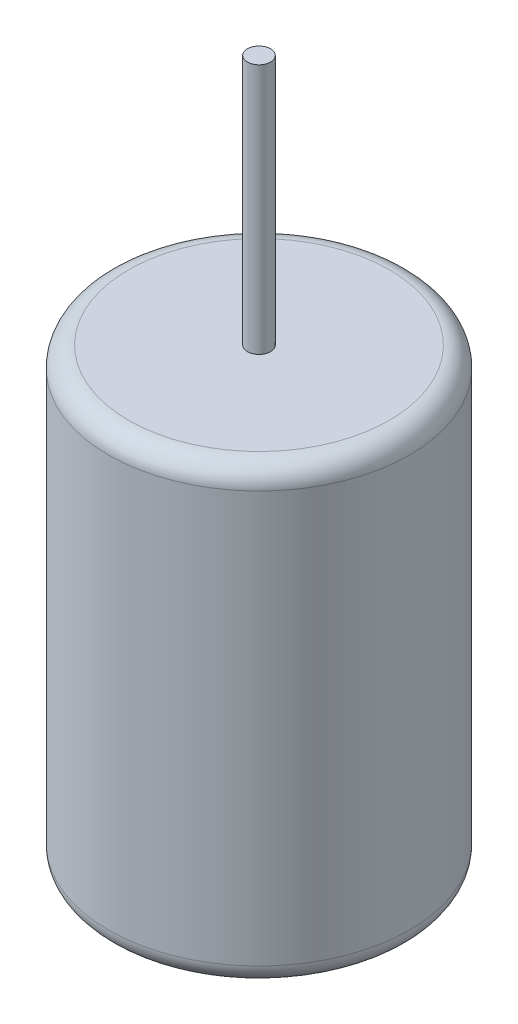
from build123d import *

# Parameters (mm, degrees)
SKETCH_1_R      = 15
EXTRUDE_1_DEPTH = 45
FILLET_1_R      = 2
SKETCH_2_R      = 1.15
EXTRUDE_2_DEPTH = 25


with BuildPart() as part:
    # Sketch 1 → Extrude 1 (new body)
    with BuildSketch(Plane(origin=(0, 0, 0), x_dir=(1, 0, 0), z_dir=(0, 1, 0))):
        with Locations(Location((0, 0, 0), (0, 0, 90))):
            Circle(SKETCH_1_R)
    extrude(amount=EXTRUDE_1_DEPTH)

    # Fillet 1
    fillet_1_edges = [part.edges().sort_by_distance(p)[0] for p in [
        (0, 0, 15),
        (0, 45, 15),
    ]]
    fillet(fillet_1_edges, radius=FILLET_1_R)

    # Sketch 2 → Extrude 2 (add)
    with BuildSketch(Plane(origin=(0, 45, 0), x_dir=(1, 0, 0), z_dir=(0, 1, 0))):
        with Locations(Location((0, 0, 0), (0, 0, 270))):
            Circle(SKETCH_2_R)
    extrude(amount=EXTRUDE_2_DEPTH)


solid = part.part
